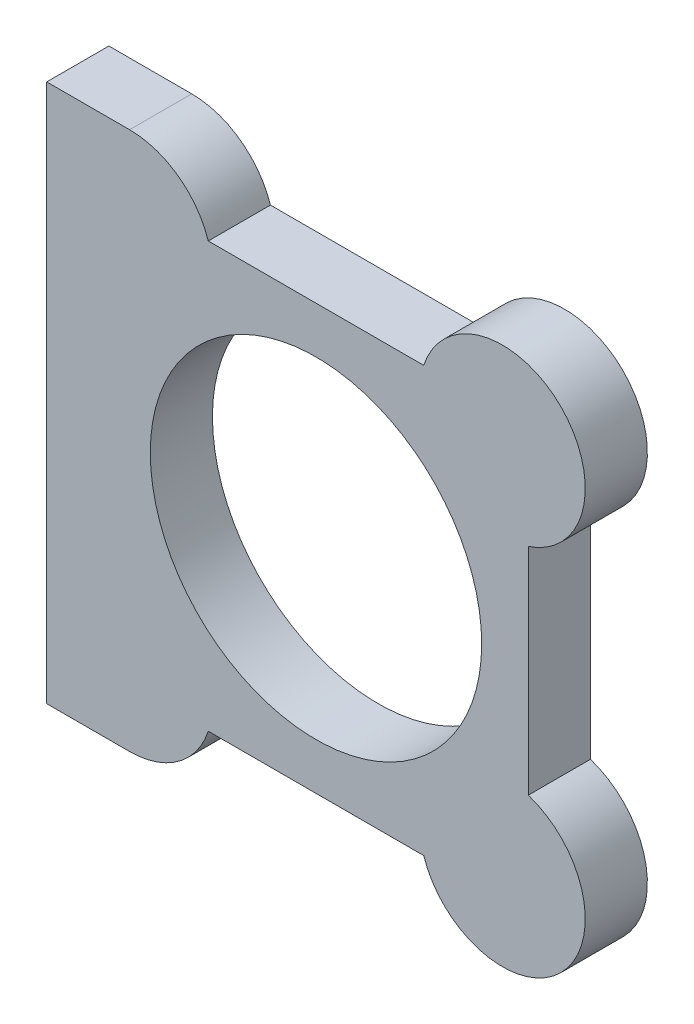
from build123d import *

# Parameters (mm, degrees)
ESQUISSE1_W             = 52
ESQUISSE1_H             = 52
BOSS_EXTRU_1_DEPTH      = 6
ESQUISSE2_R             = 16
ENL_V_MAT_EXTRU_1_DEPTH = 74.783466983


with BuildPart() as part:
    # Esquisse1 → Boss.-Extru.1 (new body)
    with BuildSketch(Plane.XY):
        with Locations((26, 26)):
            Rectangle(ESQUISSE1_W, ESQUISSE1_H)
    extrude(amount=BOSS_EXTRU_1_DEPTH)

    # Esquisse2 → Enl_v. mat.-Extru.1 (cut, through all)
    with BuildSketch(Plane.XY.offset(6)):
        with BuildLine():
            ThreePointArc((8, 52), (12.692130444, 50.479499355), (15.600664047, 46.495977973))
            Line((15.600664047, 46.495977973), (36.399335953, 46.495977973))
            ThreePointArc((36.399335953, 46.495977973), (39.307869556, 50.479499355), (44, 52))
            Line((44, 52), (8, 52))
        make_face()
        with BuildLine():
            Line((52, 52), (44, 52))
            ThreePointArc((44, 52), (49.656854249, 49.656854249), (52, 44))
            Line((52, 44), (52, 52))
        make_face()
        with BuildLine():
            Line((52, 8), (52, 44))
            ThreePointArc((52, 44), (50.480740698, 39.30958424), (46.5, 36.400657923))
            Line((46.5, 36.400657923), (46.5, 15.599342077))
            ThreePointArc((46.5, 15.599342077), (50.480740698, 12.69041576), (52, 8))
        make_face()
        with BuildLine():
            Line((52, 0), (52, 8))
            ThreePointArc((52, 8), (49.656854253, 2.343145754), (44.000000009, 0))
            Line((44.000000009, 0), (52, 0))
        make_face()
        with BuildLine():
            ThreePointArc((15.599342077, 5.5), (12.69041576, 1.519259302), (8, 0))
            Line((8, 0), (44.000000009, 0))
            ThreePointArc((44.000000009, 0), (39.309584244, 1.519259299), (36.400657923, 5.5))
            Line((36.400657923, 5.5), (15.599342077, 5.5))
        make_face()
        with Locations((26, 26)):
            Circle(ESQUISSE2_R)
    extrude(amount=-ENL_V_MAT_EXTRU_1_DEPTH, mode=Mode.SUBTRACT)


solid = part.part
